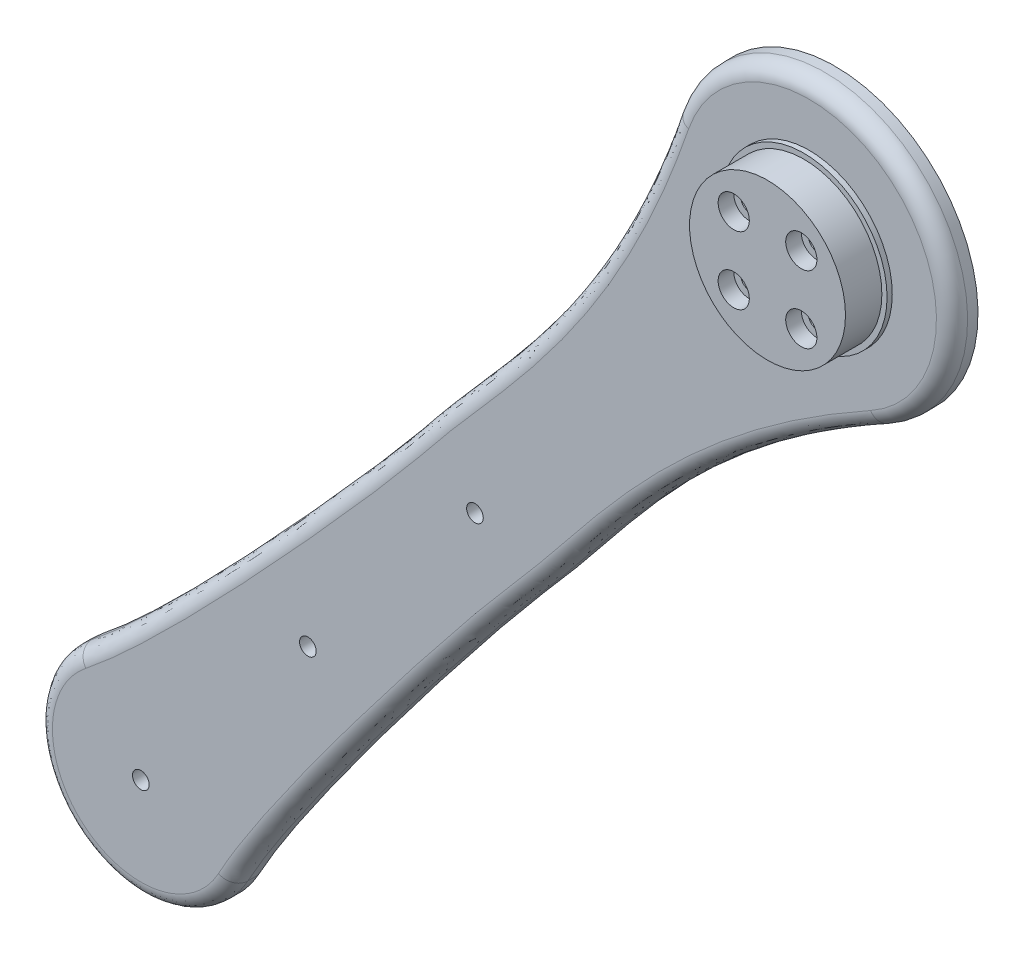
from build123d import *

# Parameters (mm, degrees)
SKETCH1_R           = 1.6
BOSS_EXTRUDE1_DEPTH = 5
SKETCH2_R           = 16
SKETCH2_R_2         = 1.6
BOSS_EXTRUDE2_DEPTH = 1
SKETCH3_R           = 15
SKETCH3_R_2         = 1.6
BOSS_EXTRUDE3_DEPTH = 7
SKETCH4_R           = 3
CUT_EXTRUDE1_DEPTH  = 3
VARFILLET1_R        = 3


with BuildPart() as part:
    # Sketch1 → Boss-Extrude1 (new body)
    with BuildSketch(Plane.XY.offset(31)):
        with BuildLine():
            ThreePointArc((155.019115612, -142.985112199), (159.394881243, -97.849485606), (115.704809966, -109.996492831))
            add(Edge.make_bspline(
                [(115.704809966, -109.996492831), (101.94879758, -150.116707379), (78.178790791, -171.772825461), (58.717079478, -197.082387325), (16.356999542, -244.049515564), (0.72448619, -256.46124476)],
                knots=[0, 0, 0, 0, 0.619090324, 0.719090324, 1, 1, 1, 1], degree=3))
            ThreePointArc((0.72448619, -256.46124476), (0.304947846, -287.445485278), (30.74561606, -281.651963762))
            add(Edge.make_bspline(
                [(155.019115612, -142.985112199), (117.897123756, -163.498941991), (100.69762913, -190.668374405), (79.152067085, -214.229377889), (40.254225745, -264.101669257), (30.74561606, -281.651963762)],
                knots=[0, 0, 0, 0, 0.619090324, 0.719090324, 1, 1, 1, 1], degree=3))
        make_face()
        with Locations((135.218221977, -112.415707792)):
            Circle(SKETCH1_R, mode=Mode.SUBTRACT)
        with Locations((148.218221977, -112.415707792)):
            Circle(SKETCH1_R, mode=Mode.SUBTRACT)
        with Locations((148.218221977, -125.415707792)):
            Circle(SKETCH1_R, mode=Mode.SUBTRACT)
        with Locations((135.218221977, -125.415707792)):
            Circle(SKETCH1_R, mode=Mode.SUBTRACT)
        with Locations((77.439461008, -195.520152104)):
            Circle(SKETCH1_R, mode=Mode.SUBTRACT)
        with Locations((45.300080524, -233.82237426)):
            Circle(SKETCH1_R, mode=Mode.SUBTRACT)
        with Locations((13.16070004, -272.124596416)):
            Circle(SKETCH1_R, mode=Mode.SUBTRACT)
    extrude(amount=BOSS_EXTRUDE1_DEPTH)

    # Sketch2 → Boss-Extrude2 (add)
    with BuildSketch(Plane.XY.offset(36)):
        with Locations((141.718221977, -118.915707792)):
            Circle(SKETCH2_R)
        with Locations((148.218221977, -125.415707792)):
            Circle(SKETCH2_R_2, mode=Mode.SUBTRACT)
        with Locations((135.218221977, -125.415707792)):
            Circle(SKETCH2_R_2, mode=Mode.SUBTRACT)
        with Locations((135.218221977, -112.415707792)):
            Circle(SKETCH2_R_2, mode=Mode.SUBTRACT)
        with Locations((148.218221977, -112.415707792)):
            Circle(SKETCH2_R_2, mode=Mode.SUBTRACT)
    extrude(amount=BOSS_EXTRUDE2_DEPTH)

    # Sketch3 → Boss-Extrude3 (add)
    with BuildSketch(Plane.XY.offset(37)):
        with Locations((141.718221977, -118.915707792)):
            Circle(SKETCH3_R)
        with Locations((148.218221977, -125.415707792)):
            Circle(SKETCH3_R_2, mode=Mode.SUBTRACT)
        with Locations((135.218221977, -112.415707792)):
            Circle(SKETCH3_R_2, mode=Mode.SUBTRACT)
        with Locations((148.218221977, -112.415707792)):
            Circle(SKETCH3_R_2, mode=Mode.SUBTRACT)
        with Locations((135.218221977, -125.415707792)):
            Circle(SKETCH3_R_2, mode=Mode.SUBTRACT)
    extrude(amount=BOSS_EXTRUDE3_DEPTH)

    # Sketch4 → Cut-Extrude1 (cut)
    with BuildSketch(Plane.XY.offset(44)):
        with Locations((135.218221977, -112.415707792)):
            Circle(SKETCH4_R)
        with Locations((148.218221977, -112.415707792)):
            Circle(SKETCH4_R)
        with Locations((148.218221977, -125.415707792)):
            Circle(SKETCH4_R)
        with Locations((135.218221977, -125.415707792)):
            Circle(SKETCH4_R)
    extrude(amount=-CUT_EXTRUDE1_DEPTH, mode=Mode.SUBTRACT)

    # VarFillet1
    varfillet1_edges = [part.edges().sort_by_distance(p)[0] for p in [
        (0.304947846, -287.445485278, 36),
        (65.360846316, -188.427744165, 36),
        (86.521548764, -206.183681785, 36),
    ]]
    fillet(varfillet1_edges, radius=VARFILLET1_R)


solid = part.part
